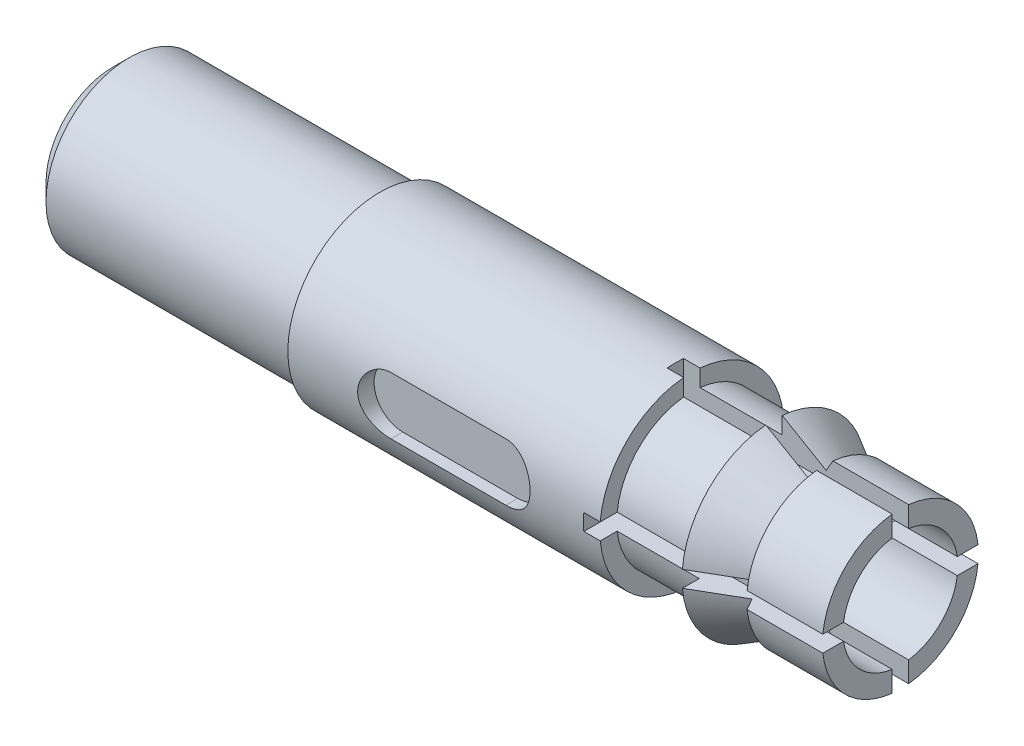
from build123d import *

# Parameters (mm, degrees)
ESQUISSE2_W                  = 1
ESQUISSE2_H                  = 11.2
ENL_V_MAT_EXTRU_1_DEPTH      = 13.7
R_P_TITION_CIRCULAIRE1_COUNT = 2
R_P_TITION_CIRCULAIRE1_ANGLE = 90
ENL_V_MAT_EXTRU_2_DEPTH      = 1
CHANFREIN1_SIZE              = 1


with BuildPart() as part:
    # Esquisse1 → R_volution1 (revolve)
    with BuildSketch(Plane.XY, mode=Mode.PRIVATE) as r_volution1_sk:
        Polygon((-23.975, 5.075), (-23.975, 3.5), (23.975, 3.5), (23.975, 4.75), (19.36382394, 4.75), (18.959678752, 4.05), (16.275, 5.6), (16.275, 4.575), (11.275, 4.575), (11.275, 5.6), (-7.725, 5.6), (-7.725, 5.075), align=None)
    revolve(r_volution1_sk.sketch.rotate(Axis((-23.975, 0, 0), (1, 0, 0)), 90), axis=Axis((-23.975, 0, 0), (1, 0, 0)))

    # Esquisse2 → Enl_v. mat.-Extru.1 (cut)
    with BuildSketch(Plane(origin=(23.975, 0, 0), x_dir=(0, 0, -1), z_dir=(1, 0, 0))):
        Rectangle(ESQUISSE2_W, ESQUISSE2_H)
    enl_v_mat_extru_1 = extrude(amount=-ENL_V_MAT_EXTRU_1_DEPTH, mode=Mode.SUBTRACT)

    # R_p_tition circulaire1: Enl_v. mat.-Extru.1 ×2 about axis
    r_p_tition_circulaire1_axis = Axis((-23.975, 0, 0), (-1, 0, 0))
    for i in range(1, R_P_TITION_CIRCULAIRE1_COUNT):
        add(enl_v_mat_extru_1.rotate(r_p_tition_circulaire1_axis, i * R_P_TITION_CIRCULAIRE1_ANGLE / (R_P_TITION_CIRCULAIRE1_COUNT - 1)), mode=Mode.SUBTRACT)

    # Esquisse7 → Enl_v. mat.-Extru.2 (cut)
    with BuildSketch(Plane(origin=(0, 0, 5.6), x_dir=(-1, 0, 0), z_dir=(0, 0, 1))):
        with BuildLine():
            Line((-5.275, -1.75), (1.725, -1.75))
            ThreePointArc((1.725, -1.75), (3.475, 0), (1.725, 1.75))
            Line((1.725, 1.75), (-5.275, 1.75))
            ThreePointArc((-5.275, 1.75), (-7.025, 0), (-5.275, -1.75))
        make_face()
    extrude(amount=-ENL_V_MAT_EXTRU_2_DEPTH, mode=Mode.SUBTRACT)

    # Chanfrein1
    chanfrein1_edges = [part.edges().sort_by_distance(p)[0] for p in [
        (-23.975, 0, -5.075),
    ]]
    chamfer(chanfrein1_edges, length=CHANFREIN1_SIZE)


solid = part.part
